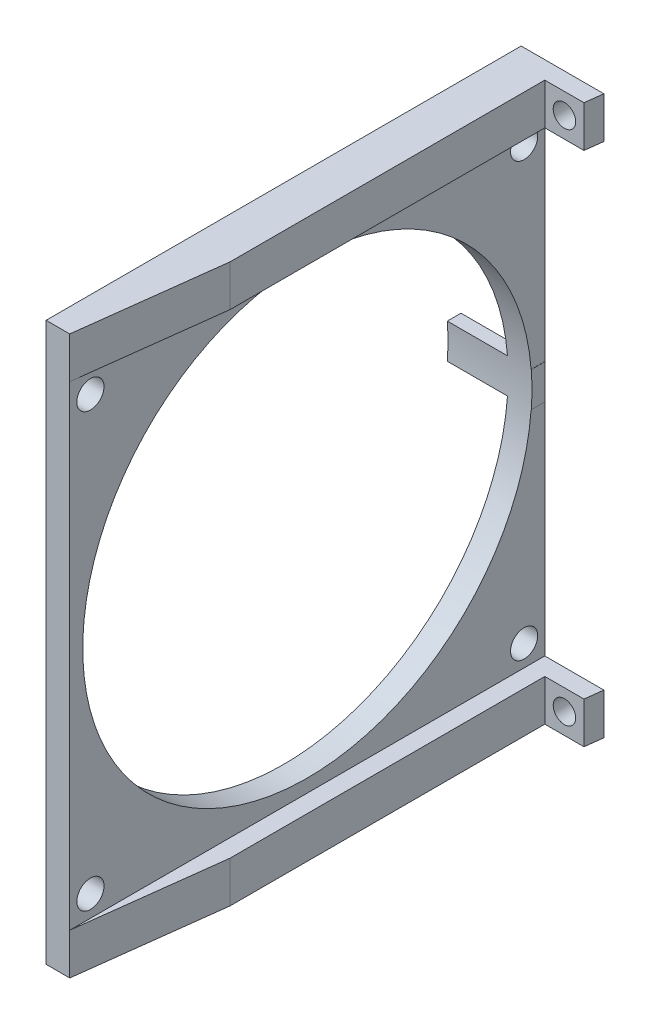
from build123d import *

# Parameters (mm, degrees)
SKETCH2_W               = 4
SKETCH2_H               = 80.4
BOSS_EXTRUDE1_DEPTH     = 80.4
SKETCH11_W              = 14.212865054
SKETCH11_H              = 5.892993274
BOSS_EXTRUDE4_DEPTH     = 4
CUT_EXTRUDE3_DEPTH      = 4
CUT_EXTRUDE3_DEPTH_BACK = 24
SKETCH3_R               = 2.3
SKETCH3_R_2             = 38
SKETCH4_W               = 80.4
SKETCH4_H               = 7
BOSS_EXTRUDE3_DEPTH     = 14
CUT_EXTRUDE5_DEPTH      = 95
SKETCH9_R               = 1.9
CUT_EXTRUDE6_DEPTH      = 95
CUT_EXTRUDE7_DEPTH      = 95


with BuildPart() as part:
    # Sketch2 → Boss-Extrude1 (new body)
    with BuildSketch(Plane(origin=(0, 0, 0), x_dir=(1, 0, 0), z_dir=(0, 1, 0))):
        with Locations((2, 40.2)):
            Rectangle(SKETCH2_W, SKETCH2_H)
    extrude(amount=BOSS_EXTRUDE1_DEPTH)

    # Sketch11 → Boss-Extrude4 (add)
    with BuildSketch(Plane(origin=(0, 0, -80.4), x_dir=(-1, 0, 0), z_dir=(0, 0, -1))):
        with Locations((3.081827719, 40.2)):
            Rectangle(SKETCH11_W, SKETCH11_H)
    extrude(amount=-BOSS_EXTRUDE4_DEPTH)

    # Sketch3 → Cut-Extrude3 (cut, two sides: drawn at the far end of the back side and taken through both)
    with BuildSketch(Plane(origin=(4, 0, 0), x_dir=(0, 0, -1), z_dir=(1, 0, 0)).offset(-CUT_EXTRUDE3_DEPTH_BACK)):
        with Locations(Location((3.5, 76.8, 0), (0, 0, 180))):
            Circle(SKETCH3_R)
        with Locations(Location((3.5, 3.6, 0), (0, 0, 180))):
            Circle(SKETCH3_R)
        with Locations(Location((76.9, 3.6, 0), (0, 0, 180))):
            Circle(SKETCH3_R)
        with Locations(Location((76.9, 76.8, 0), (0, 0, 180))):
            Circle(SKETCH3_R)
        with Locations(Location((40.2, 40.2, 0), (0, 0, 355.552856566))):
            Circle(SKETCH3_R_2)
    extrude(amount=CUT_EXTRUDE3_DEPTH + CUT_EXTRUDE3_DEPTH_BACK, mode=Mode.SUBTRACT)

    # Sketch4 → Boss-Extrude3 (add)
    with BuildSketch(Plane.ZY):
        with Locations((-40.2, -3.5)):
            Rectangle(SKETCH4_W, SKETCH4_H)
        with Locations((-40.2, 83.9)):
            Rectangle(SKETCH4_W, SKETCH4_H)
    extrude(amount=-BOSS_EXTRUDE3_DEPTH)

    # Sketch8 → Cut-Extrude5 (cut)
    with BuildSketch(Plane(origin=(0, 87.4, 0), x_dir=(1, 0, 0), z_dir=(0, 1, 0))):
        Polygon((4, 0), (14, 0), (14, 80.4), align=None)
    extrude(amount=-CUT_EXTRUDE5_DEPTH, mode=Mode.SUBTRACT)

    # Sketch9 → Cut-Extrude6 (cut)
    with BuildSketch(Plane(origin=(0, 0, -80.4), x_dir=(-1, 0, 0), z_dir=(0, 0, -1))):
        with Locations((-10.320931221, 83.9)):
            Circle(SKETCH9_R)
        with Locations(Location((-10.320931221, -3.5, 0), (0, 0, 180))):
            Circle(SKETCH9_R)
    extrude(amount=-CUT_EXTRUDE6_DEPTH, mode=Mode.SUBTRACT)

    # Sketch10 → Cut-Extrude7 (cut)
    with BuildSketch(Plane(origin=(0, 87.4, 0), x_dir=(1, 0, 0), z_dir=(0, 1, 0))):
        Polygon((7, 77.4), (13.626865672, 77.4), (7, 24.12), align=None)
    extrude(amount=-CUT_EXTRUDE7_DEPTH, mode=Mode.SUBTRACT)


solid = part.part
